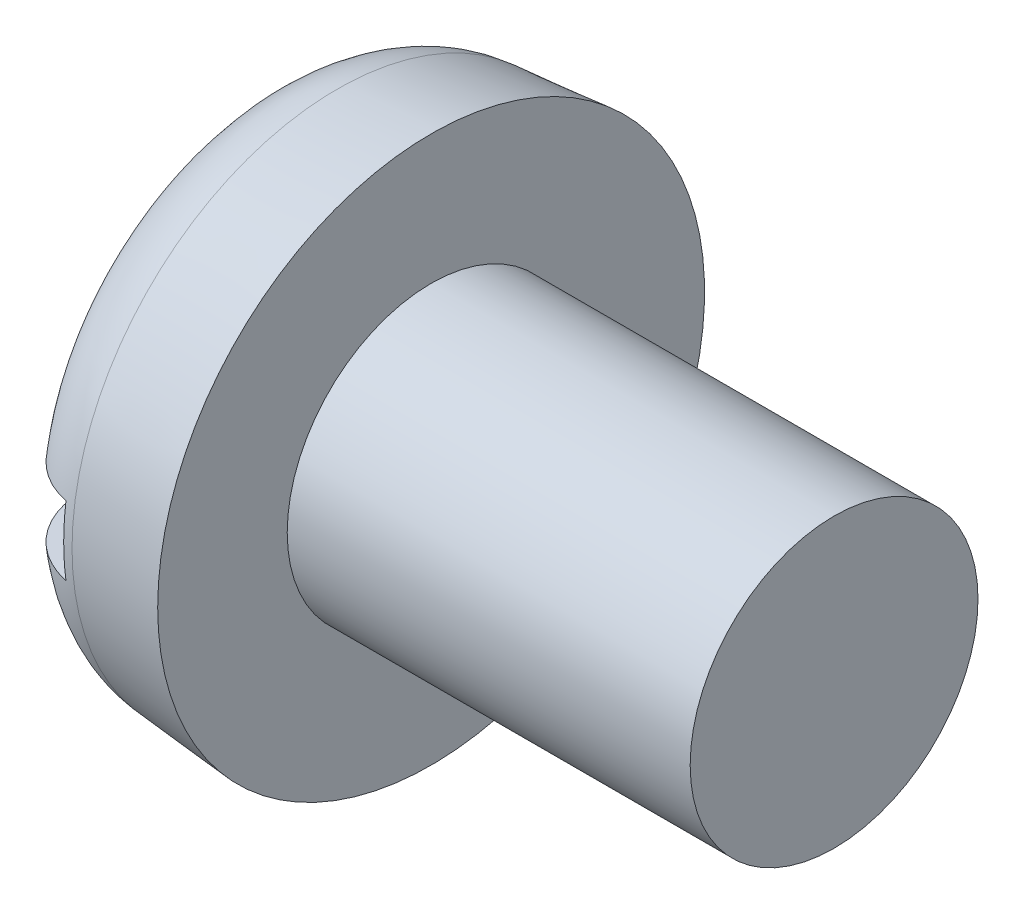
from build123d import *

# Parameters (mm, degrees)
FILLET2_R  = 1.5
SKETCH2_W  = 9.5
SKETCH2_H  = 1.2
SLOT_DEPTH = 1.2


with BuildPart() as part:
    # BodySke → Base-Revolve (revolve)
    with BuildSketch(Plane.XY, mode=Mode.PRIVATE) as base_revolve_sk:
        Polygon((3, 2.5), (3, 4.75), (0, 4.487534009), (0, 0), (10, 0), (10, 2.5), align=None)
    revolve(base_revolve_sk.sketch.rotate(Axis((-25.4, 0, 0), (1, 0, 0)), 90), axis=Axis((-25.4, 0, 0), (1, 0, 0)))

    # Fillet2
    fillet2_edges = [part.edges().sort_by_distance(p)[0] for p in [
        (0, 0, -4.487534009),
    ]]
    fillet(fillet2_edges, radius=FILLET2_R)

    # Sketch2 → Slot (cut)
    with BuildSketch(Plane(origin=(0, 0, 0), x_dir=(0, 0, -1), z_dir=(1, 0, 0))):
        Rectangle(SKETCH2_W, SKETCH2_H)
    extrude(amount=SLOT_DEPTH, mode=Mode.SUBTRACT)


solid = part.part
